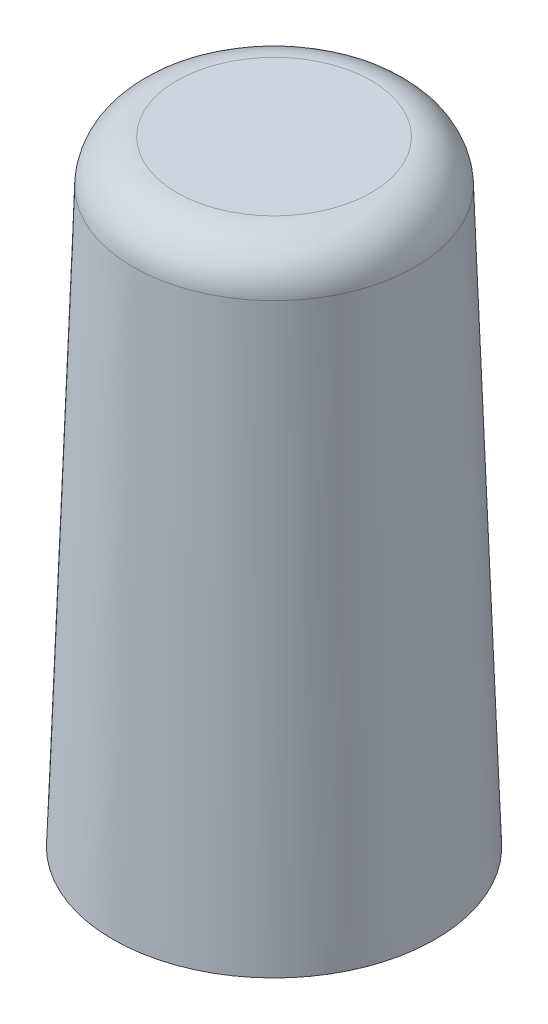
from build123d import *

# Parameters (mm, degrees)
SKETCH1_R           = 11
BOSS_EXTRUDE1_DEPTH = 42
BOSS_EXTRUDE1_TAPER = 2
FILLET1_R           = 3


with BuildPart() as part:
    # Sketch1 → Boss-Extrude1 (new body)
    with BuildSketch(Plane(origin=(0, 0, 0), x_dir=(1, 0, 0), z_dir=(0, 1, 0))):
        Circle(SKETCH1_R)
    extrude(amount=BOSS_EXTRUDE1_DEPTH, taper=BOSS_EXTRUDE1_TAPER)

    # Fillet1
    fillet1_edges = [part.edges().sort_by_distance(p)[0] for p in [
        (-9.533327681, 42, 0),
    ]]
    fillet(fillet1_edges, radius=FILLET1_R)


solid = part.part
